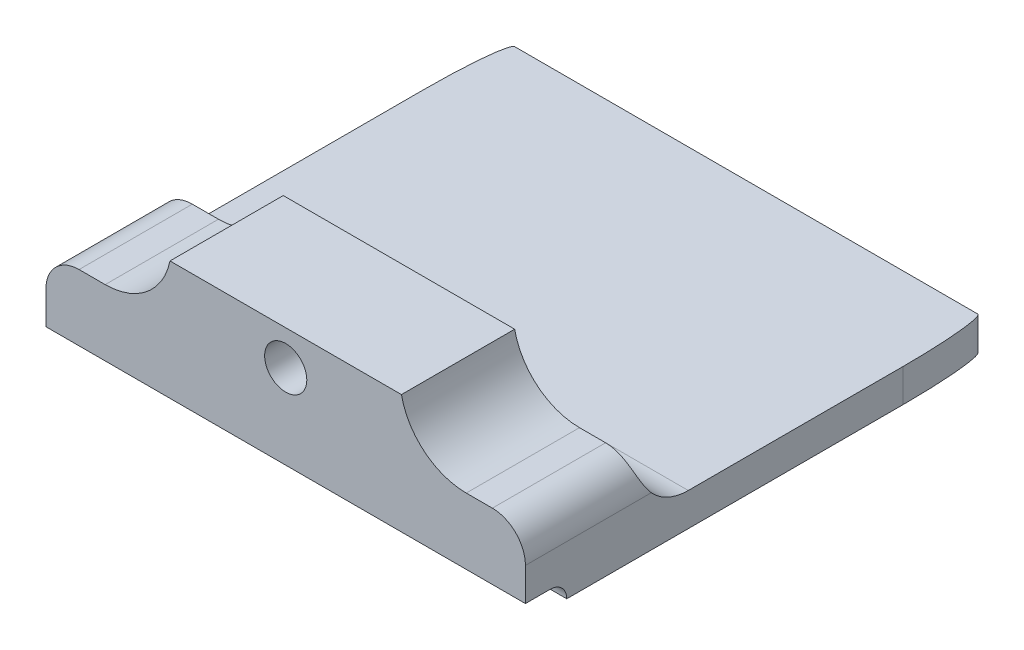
ISO-10303-21;
HEADER;
FILE_DESCRIPTION(('STEP AP214'),'2;1');
FILE_NAME('part.step','',(''),(''),'','','');
FILE_SCHEMA(('AUTOMOTIVE_DESIGN { 1 0 10303 214 1 1 1 1 }'));
ENDSEC;
DATA;
#1=APPLICATION_CONTEXT('core data for automotive mechanical design processes');
#2=APPLICATION_PROTOCOL_DEFINITION('international standard','automotive_design',2000,#1);
#3=PRODUCT_CONTEXT('',#1,'mechanical');
#4=PRODUCT('Part','Part','',(#3));
#5=PRODUCT_RELATED_PRODUCT_CATEGORY('part','',(#4));
#6=PRODUCT_DEFINITION_FORMATION('','',#4);
#7=PRODUCT_DEFINITION_CONTEXT('part definition',#1,'design');
#8=PRODUCT_DEFINITION('design','',#6,#7);
#9=PRODUCT_DEFINITION_SHAPE('','',#8);
#10=(LENGTH_UNIT() NAMED_UNIT(*) SI_UNIT(.MILLI.,.METRE.));
#11=(NAMED_UNIT(*) PLANE_ANGLE_UNIT() SI_UNIT($,.RADIAN.));
#12=(NAMED_UNIT(*) SI_UNIT($,.STERADIAN.) SOLID_ANGLE_UNIT());
#13=UNCERTAINTY_MEASURE_WITH_UNIT(LENGTH_MEASURE(1.E-05),#10,'distance_accuracy_value','');
#14=(GEOMETRIC_REPRESENTATION_CONTEXT(3) GLOBAL_UNCERTAINTY_ASSIGNED_CONTEXT((#13)) GLOBAL_UNIT_ASSIGNED_CONTEXT((#10,
#11,#12)) REPRESENTATION_CONTEXT('',''));
#15=CARTESIAN_POINT('',(0.,0.,0.));
#16=DIRECTION('',(0.,0.,1.));
#17=DIRECTION('',(1.,0.,0.));
#18=AXIS2_PLACEMENT_3D('',#15,#16,#17);
#19=CARTESIAN_POINT('',(0.,0.,-13.7));
#20=DIRECTION('',(0.,0.,1.));
#21=DIRECTION('',(1.,0.,0.));
#22=AXIS2_PLACEMENT_3D('',#19,#20,#21);
#23=PLANE('',#22);
#24=DIRECTION('',(1.,0.,0.));
#25=VECTOR('',#24,1.);
#26=CARTESIAN_POINT('',(-29.,-2.2,-13.7));
#27=LINE('',#26,#25);
#28=CARTESIAN_POINT('',(21.8383671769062,-2.2,-13.7));
#29=VERTEX_POINT('',#28);
#30=CARTESIAN_POINT('',(-21.8383671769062,-2.2,-13.7));
#31=VERTEX_POINT('',#30);
#32=EDGE_CURVE('E333',#29,#31,#27,.F.);
#33=ORIENTED_EDGE('',*,*,#32,.T.);
#34=CARTESIAN_POINT('',(-21.8383671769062,5.8,-13.7));
#35=DIRECTION('',(0.,0.,1.));
#36=DIRECTION('',(1.,0.,0.));
#37=AXIS2_PLACEMENT_3D('',#34,#35,#36);
#38=CIRCLE('',#37,8.);
#39=CARTESIAN_POINT('',(-14.,4.2,-13.7));
#40=VERTEX_POINT('',#39);
#41=EDGE_CURVE('E356',#31,#40,#38,.T.);
#42=ORIENTED_EDGE('',*,*,#41,.T.);
#43=DIRECTION('',(1.,0.,0.));
#44=VECTOR('',#43,1.);
#45=CARTESIAN_POINT('',(29.,4.2,-13.7));
#46=LINE('',#45,#44);
#47=CARTESIAN_POINT('',(14.,4.2,-13.7));
#48=VERTEX_POINT('',#47);
#49=EDGE_CURVE('E436',#40,#48,#46,.T.);
#50=ORIENTED_EDGE('',*,*,#49,.T.);
#51=CARTESIAN_POINT('',(21.8383671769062,5.8,-13.7));
#52=DIRECTION('',(0.,0.,1.));
#53=DIRECTION('',(1.,0.,0.));
#54=AXIS2_PLACEMENT_3D('',#51,#52,#53);
#55=CIRCLE('',#54,8.);
#56=EDGE_CURVE('E350',#48,#29,#55,.T.);
#57=ORIENTED_EDGE('',*,*,#56,.T.);
#58=EDGE_LOOP('',(#33,#42,#50,#57));
#59=FACE_BOUND('',#58,.T.);
#60=ADVANCED_FACE('F43',(#59),#23,.F.);
#61=CARTESIAN_POINT('',(-29.,-12.2,-12.2));
#62=DIRECTION('',(-1.,0.,0.));
#63=DIRECTION('',(0.,0.,1.));
#64=AXIS2_PLACEMENT_3D('',#61,#62,#63);
#65=PLANE('',#64);
#66=DIRECTION('',(0.,0.,1.));
#67=VECTOR('',#66,1.);
#68=CARTESIAN_POINT('',(-29.,-12.2,-12.2));
#69=LINE('',#68,#67);
#70=CARTESIAN_POINT('',(-29.,-12.2,-45.7));
#71=VERTEX_POINT('',#70);
#72=CARTESIAN_POINT('',(-29.,-12.2,-5.));
#73=VERTEX_POINT('',#72);
#74=EDGE_CURVE('E183',#71,#73,#69,.T.);
#75=ORIENTED_EDGE('',*,*,#74,.T.);
#76=CARTESIAN_POINT('',(-29.,-12.2,-3.));
#77=DIRECTION('',(-1.,0.,0.));
#78=DIRECTION('',(0.,0.,1.));
#79=AXIS2_PLACEMENT_3D('',#76,#77,#78);
#80=CIRCLE('',#79,2.);
#81=CARTESIAN_POINT('',(-29.,-10.2,-3.));
#82=VERTEX_POINT('',#81);
#83=EDGE_CURVE('E51',#73,#82,#80,.F.);
#84=ORIENTED_EDGE('',*,*,#83,.T.);
#85=DIRECTION('',(0.,0.,-1.));
#86=VECTOR('',#85,1.);
#87=CARTESIAN_POINT('',(-29.,-10.2,0.));
#88=LINE('',#87,#86);
#89=CARTESIAN_POINT('',(-29.,-10.2,0.));
#90=VERTEX_POINT('',#89);
#91=EDGE_CURVE('E155',#90,#82,#88,.T.);
#92=ORIENTED_EDGE('',*,*,#91,.F.);
#93=DIRECTION('',(0.,-1.,0.));
#94=VECTOR('',#93,1.);
#95=CARTESIAN_POINT('',(-29.,-12.2,0.));
#96=LINE('',#95,#94);
#97=CARTESIAN_POINT('',(-29.,-6.2,0.));
#98=VERTEX_POINT('',#97);
#99=EDGE_CURVE('E164',#98,#90,#96,.T.);
#100=ORIENTED_EDGE('',*,*,#99,.F.);
#101=DIRECTION('',(0.,0.,1.));
#102=VECTOR('',#101,1.);
#103=CARTESIAN_POINT('',(-29.,-6.2,-13.7));
#104=LINE('',#103,#102);
#105=CARTESIAN_POINT('',(-29.,-6.2,-15.2278640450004));
#106=VERTEX_POINT('',#105);
#107=EDGE_CURVE('E160',#98,#106,#104,.F.);
#108=ORIENTED_EDGE('',*,*,#107,.T.);
#109=CARTESIAN_POINT('',(-29.,-2.2,-19.7));
#110=DIRECTION('',(-1.,0.,0.));
#111=DIRECTION('',(0.,0.,1.));
#112=AXIS2_PLACEMENT_3D('',#109,#110,#111);
#113=CIRCLE('',#112,6.);
#114=CARTESIAN_POINT('',(-29.,-8.2,-19.7));
#115=VERTEX_POINT('',#114);
#116=EDGE_CURVE('E340',#106,#115,#113,.F.);
#117=ORIENTED_EDGE('',*,*,#116,.T.);
#118=DIRECTION('',(0.,0.,1.));
#119=VECTOR('',#118,1.);
#120=CARTESIAN_POINT('',(-29.,-8.2,-55.7));
#121=LINE('',#120,#119);
#122=CARTESIAN_POINT('',(-29.,-8.2,-45.7));
#123=VERTEX_POINT('',#122);
#124=EDGE_CURVE('E455',#123,#115,#121,.T.);
#125=ORIENTED_EDGE('',*,*,#124,.F.);
#126=CARTESIAN_POINT('',(-29.,-12.4,-45.7));
#127=CARTESIAN_POINT('',(-29.,-10.9333333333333,-45.7));
#128=CARTESIAN_POINT('',(-29.,-9.46666666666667,-45.7));
#129=CARTESIAN_POINT('',(-29.,-8.,-45.7));
#130=(BOUNDED_CURVE() B_SPLINE_CURVE(3,(#126,#127,#128,#129),.UNSPECIFIED.,.F.,
.F.) B_SPLINE_CURVE_WITH_KNOTS((4,4),(0.008,0.0124),
.UNSPECIFIED.) CURVE() GEOMETRIC_REPRESENTATION_ITEM() RATIONAL_B_SPLINE_CURVE((1.,1.,1.,1.)) REPRESENTATION_ITEM(''));
#131=EDGE_CURVE('E482',#123,#71,#130,.F.);
#132=ORIENTED_EDGE('',*,*,#131,.T.);
#133=EDGE_LOOP('',(#75,#84,#92,#100,#108,#117,#125,#132));
#134=FACE_BOUND('',#133,.T.);
#135=ADVANCED_FACE('F163',(#134),#65,.T.);
#136=CARTESIAN_POINT('',(-29.,4.2,-12.2));
#137=DIRECTION('',(0.,1.,0.));
#138=DIRECTION('',(0.,0.,1.));
#139=AXIS2_PLACEMENT_3D('',#136,#137,#138);
#140=PLANE('',#139);
#141=DIRECTION('',(0.,0.,1.));
#142=VECTOR('',#141,1.);
#143=CARTESIAN_POINT('',(-14.,4.2,-55.751));
#144=LINE('',#143,#142);
#145=CARTESIAN_POINT('',(-14.,4.2,0.));
#146=VERTEX_POINT('',#145);
#147=EDGE_CURVE('E433',#40,#146,#144,.T.);
#148=ORIENTED_EDGE('',*,*,#147,.T.);
#149=DIRECTION('',(-1.,0.,0.));
#150=VECTOR('',#149,1.);
#151=CARTESIAN_POINT('',(-29.,4.2,0.));
#152=LINE('',#151,#150);
#153=CARTESIAN_POINT('',(14.,4.2,0.));
#154=VERTEX_POINT('',#153);
#155=EDGE_CURVE('E174',#154,#146,#152,.T.);
#156=ORIENTED_EDGE('',*,*,#155,.F.);
#157=DIRECTION('',(0.,0.,1.));
#158=VECTOR('',#157,1.);
#159=CARTESIAN_POINT('',(14.,4.2,-55.751));
#160=LINE('',#159,#158);
#161=EDGE_CURVE('E446',#48,#154,#160,.T.);
#162=ORIENTED_EDGE('',*,*,#161,.F.);
#163=ORIENTED_EDGE('',*,*,#49,.F.);
#164=EDGE_LOOP('',(#148,#156,#162,#163));
#165=FACE_BOUND('',#164,.T.);
#166=ADVANCED_FACE('F407',(#165),#140,.T.);
#167=CARTESIAN_POINT('',(29.,-12.2,-12.2));
#168=DIRECTION('',(1.,0.,0.));
#169=DIRECTION('',(0.,0.,-1.));
#170=AXIS2_PLACEMENT_3D('',#167,#168,#169);
#171=PLANE('',#170);
#172=DIRECTION('',(0.,0.,1.));
#173=VECTOR('',#172,1.);
#174=CARTESIAN_POINT('',(29.,-10.2,-12.2));
#175=LINE('',#174,#173);
#176=CARTESIAN_POINT('',(29.,-10.2,-3.));
#177=VERTEX_POINT('',#176);
#178=CARTESIAN_POINT('',(29.,-10.2,0.));
#179=VERTEX_POINT('',#178);
#180=EDGE_CURVE('E156',#177,#179,#175,.T.);
#181=ORIENTED_EDGE('',*,*,#180,.F.);
#182=CARTESIAN_POINT('',(29.,-12.2,-3.));
#183=DIRECTION('',(1.,0.,0.));
#184=DIRECTION('',(0.,0.,-1.));
#185=AXIS2_PLACEMENT_3D('',#182,#183,#184);
#186=CIRCLE('',#185,2.);
#187=CARTESIAN_POINT('',(29.,-12.2,-5.));
#188=VERTEX_POINT('',#187);
#189=EDGE_CURVE('E12',#177,#188,#186,.F.);
#190=ORIENTED_EDGE('',*,*,#189,.T.);
#191=DIRECTION('',(0.,0.,1.));
#192=VECTOR('',#191,1.);
#193=CARTESIAN_POINT('',(29.,-12.2,-12.2));
#194=LINE('',#193,#192);
#195=CARTESIAN_POINT('',(29.,-12.2,-45.7));
#196=VERTEX_POINT('',#195);
#197=EDGE_CURVE('E189',#196,#188,#194,.T.);
#198=ORIENTED_EDGE('',*,*,#197,.F.);
#199=CARTESIAN_POINT('',(29.,-8.,-45.7));
#200=CARTESIAN_POINT('',(29.,-9.46666666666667,-45.7));
#201=CARTESIAN_POINT('',(29.,-10.9333333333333,-45.7));
#202=CARTESIAN_POINT('',(29.,-12.4,-45.7));
#203=(BOUNDED_CURVE() B_SPLINE_CURVE(3,(#199,#200,#201,#202),.UNSPECIFIED.,.F.,
.F.) B_SPLINE_CURVE_WITH_KNOTS((4,4),(-0.0124,-0.008),
.UNSPECIFIED.) CURVE() GEOMETRIC_REPRESENTATION_ITEM() RATIONAL_B_SPLINE_CURVE((1.,1.,1.,1.)) REPRESENTATION_ITEM(''));
#204=CARTESIAN_POINT('',(29.,-8.2,-45.7));
#205=VERTEX_POINT('',#204);
#206=EDGE_CURVE('E499',#196,#205,#203,.F.);
#207=ORIENTED_EDGE('',*,*,#206,.T.);
#208=DIRECTION('',(0.,0.,1.));
#209=VECTOR('',#208,1.);
#210=CARTESIAN_POINT('',(29.,-8.2,-55.7));
#211=LINE('',#210,#209);
#212=CARTESIAN_POINT('',(29.,-8.2,-19.7));
#213=VERTEX_POINT('',#212);
#214=EDGE_CURVE('E207',#205,#213,#211,.T.);
#215=ORIENTED_EDGE('',*,*,#214,.T.);
#216=CARTESIAN_POINT('',(29.,-2.2,-19.7));
#217=DIRECTION('',(1.,0.,0.));
#218=DIRECTION('',(0.,0.,-1.));
#219=AXIS2_PLACEMENT_3D('',#216,#217,#218);
#220=CIRCLE('',#219,6.);
#221=CARTESIAN_POINT('',(29.,-6.2,-15.2278640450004));
#222=VERTEX_POINT('',#221);
#223=EDGE_CURVE('E337',#213,#222,#220,.F.);
#224=ORIENTED_EDGE('',*,*,#223,.T.);
#225=DIRECTION('',(0.,0.,1.));
#226=VECTOR('',#225,1.);
#227=CARTESIAN_POINT('',(29.,-6.2,0.));
#228=LINE('',#227,#226);
#229=CARTESIAN_POINT('',(29.,-6.2,0.));
#230=VERTEX_POINT('',#229);
#231=EDGE_CURVE('E358',#222,#230,#228,.T.);
#232=ORIENTED_EDGE('',*,*,#231,.T.);
#233=DIRECTION('',(0.,1.,0.));
#234=VECTOR('',#233,1.);
#235=CARTESIAN_POINT('',(29.,-12.2,0.));
#236=LINE('',#235,#234);
#237=EDGE_CURVE('E171',#179,#230,#236,.T.);
#238=ORIENTED_EDGE('',*,*,#237,.F.);
#239=EDGE_LOOP('',(#181,#190,#198,#207,#215,#224,#232,#238));
#240=FACE_BOUND('',#239,.T.);
#241=ADVANCED_FACE('F220',(#240),#171,.T.);
#242=CARTESIAN_POINT('',(-29.,-12.2,-12.2));
#243=DIRECTION('',(0.,-1.,0.));
#244=DIRECTION('',(0.,0.,-1.));
#245=AXIS2_PLACEMENT_3D('',#242,#243,#244);
#246=PLANE('',#245);
#247=DIRECTION('',(-1.,0.,0.));
#248=VECTOR('',#247,1.);
#249=CARTESIAN_POINT('',(29.05,-12.2,-5.));
#250=LINE('',#249,#248);
#251=EDGE_CURVE('E166',#188,#73,#250,.T.);
#252=ORIENTED_EDGE('',*,*,#251,.T.);
#253=ORIENTED_EDGE('',*,*,#74,.F.);
#254=CARTESIAN_POINT('',(-28.,-12.2,-55.7));
#255=CARTESIAN_POINT('',(-29.,-12.2,-55.7));
#256=CARTESIAN_POINT('',(-29.,-12.2,-45.7));
#257=(BOUNDED_CURVE() B_SPLINE_CURVE(2,(#254,#255,#256),.UNSPECIFIED.,.F.,
.F.) B_SPLINE_CURVE_WITH_KNOTS((3,3),(0.,1.),
.UNSPECIFIED.) CURVE() GEOMETRIC_REPRESENTATION_ITEM() RATIONAL_B_SPLINE_CURVE((1.,
0.707106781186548,1.)) REPRESENTATION_ITEM(''));
#258=CARTESIAN_POINT('',(-28.,-12.2,-55.7));
#259=VERTEX_POINT('',#258);
#260=EDGE_CURVE('E334',#71,#259,#257,.F.);
#261=ORIENTED_EDGE('',*,*,#260,.T.);
#262=DIRECTION('',(-1.,0.,0.));
#263=VECTOR('',#262,1.);
#264=CARTESIAN_POINT('',(29.,-12.2,-55.7));
#265=LINE('',#264,#263);
#266=CARTESIAN_POINT('',(28.,-12.2,-55.7));
#267=VERTEX_POINT('',#266);
#268=EDGE_CURVE('E508',#267,#259,#265,.T.);
#269=ORIENTED_EDGE('',*,*,#268,.F.);
#270=CARTESIAN_POINT('',(29.,-12.2,-45.7));
#271=CARTESIAN_POINT('',(29.,-12.2,-55.7));
#272=CARTESIAN_POINT('',(28.,-12.2,-55.7));
#273=(BOUNDED_CURVE() B_SPLINE_CURVE(2,(#270,#271,#272),.UNSPECIFIED.,.F.,
.F.) B_SPLINE_CURVE_WITH_KNOTS((3,3),(0.,1.),
.UNSPECIFIED.) CURVE() GEOMETRIC_REPRESENTATION_ITEM() RATIONAL_B_SPLINE_CURVE((1.,
0.707106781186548,1.)) REPRESENTATION_ITEM(''));
#274=EDGE_CURVE('E201',#267,#196,#273,.F.);
#275=ORIENTED_EDGE('',*,*,#274,.T.);
#276=ORIENTED_EDGE('',*,*,#197,.T.);
#277=EDGE_LOOP('',(#252,#253,#261,#269,#275,#276));
#278=FACE_BOUND('',#277,.T.);
#279=ADVANCED_FACE('F210',(#278),#246,.T.);
#280=CARTESIAN_POINT('',(0.,0.,0.));
#281=DIRECTION('',(0.,0.,-1.));
#282=DIRECTION('',(-1.,0.,0.));
#283=AXIS2_PLACEMENT_3D('',#280,#281,#282);
#284=PLANE('',#283);
#285=CARTESIAN_POINT('',(0.,0.,0.));
#286=DIRECTION('',(0.,0.,1.));
#287=DIRECTION('',(1.,0.,0.));
#288=AXIS2_PLACEMENT_3D('',#285,#286,#287);
#289=CIRCLE('',#288,2.55);
#290=CARTESIAN_POINT('',(2.55,0.,0.));
#291=VERTEX_POINT('',#290);
#292=EDGE_CURVE('E177',#291,#291,#289,.T.);
#293=ORIENTED_EDGE('',*,*,#292,.F.);
#294=EDGE_LOOP('',(#293));
#295=FACE_BOUND('',#294,.T.);
#296=ORIENTED_EDGE('',*,*,#99,.T.);
#297=DIRECTION('',(1.,0.,0.));
#298=VECTOR('',#297,1.);
#299=CARTESIAN_POINT('',(0.,-10.2,0.));
#300=LINE('',#299,#298);
#301=EDGE_CURVE('E153',#90,#179,#300,.T.);
#302=ORIENTED_EDGE('',*,*,#301,.T.);
#303=ORIENTED_EDGE('',*,*,#237,.T.);
#304=CARTESIAN_POINT('',(25.,-6.2,0.));
#305=DIRECTION('',(0.,0.,-1.));
#306=DIRECTION('',(-1.,0.,0.));
#307=AXIS2_PLACEMENT_3D('',#304,#305,#306);
#308=CIRCLE('',#307,4.);
#309=CARTESIAN_POINT('',(25.,-2.2,0.));
#310=VERTEX_POINT('',#309);
#311=EDGE_CURVE('E362',#230,#310,#308,.F.);
#312=ORIENTED_EDGE('',*,*,#311,.T.);
#313=DIRECTION('',(1.,0.,0.));
#314=VECTOR('',#313,1.);
#315=CARTESIAN_POINT('',(29.,-2.2,0.));
#316=LINE('',#315,#314);
#317=CARTESIAN_POINT('',(21.8383671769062,-2.2,0.));
#318=VERTEX_POINT('',#317);
#319=EDGE_CURVE('E444',#318,#310,#316,.T.);
#320=ORIENTED_EDGE('',*,*,#319,.F.);
#321=CARTESIAN_POINT('',(21.8383671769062,5.8,0.));
#322=DIRECTION('',(0.,0.,-1.));
#323=DIRECTION('',(-1.,0.,0.));
#324=AXIS2_PLACEMENT_3D('',#321,#322,#323);
#325=CIRCLE('',#324,8.);
#326=EDGE_CURVE('E348',#318,#154,#325,.T.);
#327=ORIENTED_EDGE('',*,*,#326,.T.);
#328=ORIENTED_EDGE('',*,*,#155,.T.);
#329=CARTESIAN_POINT('',(-21.8383671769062,5.8,0.));
#330=DIRECTION('',(0.,0.,-1.));
#331=DIRECTION('',(-1.,0.,0.));
#332=AXIS2_PLACEMENT_3D('',#329,#330,#331);
#333=CIRCLE('',#332,8.);
#334=CARTESIAN_POINT('',(-21.8383671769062,-2.2,0.));
#335=VERTEX_POINT('',#334);
#336=EDGE_CURVE('E353',#146,#335,#333,.T.);
#337=ORIENTED_EDGE('',*,*,#336,.T.);
#338=DIRECTION('',(1.,0.,0.));
#339=VECTOR('',#338,1.);
#340=CARTESIAN_POINT('',(-29.,-2.2,0.));
#341=LINE('',#340,#339);
#342=CARTESIAN_POINT('',(-25.,-2.2,0.));
#343=VERTEX_POINT('',#342);
#344=EDGE_CURVE('E439',#343,#335,#341,.T.);
#345=ORIENTED_EDGE('',*,*,#344,.F.);
#346=CARTESIAN_POINT('',(-25.,-6.2,0.));
#347=DIRECTION('',(0.,0.,-1.));
#348=DIRECTION('',(-1.,0.,0.));
#349=AXIS2_PLACEMENT_3D('',#346,#347,#348);
#350=CIRCLE('',#349,4.);
#351=EDGE_CURVE('E170',#343,#98,#350,.F.);
#352=ORIENTED_EDGE('',*,*,#351,.T.);
#353=EDGE_LOOP('',(#296,#302,#303,#312,#320,#327,#328,#337,#345,#352));
#354=FACE_BOUND('',#353,.T.);
#355=ADVANCED_FACE('F168',(#295,#354),#284,.F.);
#356=CARTESIAN_POINT('',(0.,0.,-12.2));
#357=DIRECTION('',(0.,0.,1.));
#358=DIRECTION('',(1.,0.,0.));
#359=AXIS2_PLACEMENT_3D('',#356,#357,#358);
#360=CYLINDRICAL_SURFACE('',#359,2.55);
#361=CARTESIAN_POINT('',(0.,0.,-12.2));
#362=DIRECTION('',(0.,0.,1.));
#363=DIRECTION('',(1.,0.,0.));
#364=AXIS2_PLACEMENT_3D('',#361,#362,#363);
#365=CIRCLE('',#364,2.55);
#366=CARTESIAN_POINT('',(2.55,0.,-12.2));
#367=VERTEX_POINT('',#366);
#368=EDGE_CURVE('E172',#367,#367,#365,.T.);
#369=ORIENTED_EDGE('',*,*,#368,.F.);
#370=EDGE_LOOP('',(#369));
#371=FACE_BOUND('',#370,.T.);
#372=ORIENTED_EDGE('',*,*,#292,.T.);
#373=EDGE_LOOP('',(#372));
#374=FACE_BOUND('',#373,.T.);
#375=ADVANCED_FACE('F415',(#371,#374),#360,.F.);
#376=CARTESIAN_POINT('',(0.,0.,-12.2));
#377=DIRECTION('',(0.,0.,1.));
#378=DIRECTION('',(1.,0.,0.));
#379=AXIS2_PLACEMENT_3D('',#376,#377,#378);
#380=PLANE('',#379);
#381=ORIENTED_EDGE('',*,*,#368,.T.);
#382=EDGE_LOOP('',(#381));
#383=FACE_BOUND('',#382,.T.);
#384=ADVANCED_FACE('F412',(#383),#380,.T.);
#385=CARTESIAN_POINT('',(29.,-8.2,-55.7));
#386=DIRECTION('',(0.,-1.,0.));
#387=DIRECTION('',(0.,0.,-1.));
#388=AXIS2_PLACEMENT_3D('',#385,#386,#387);
#389=PLANE('',#388);
#390=ORIENTED_EDGE('',*,*,#124,.T.);
#391=DIRECTION('',(1.,0.,0.));
#392=VECTOR('',#391,1.);
#393=CARTESIAN_POINT('',(29.,-8.2,-19.7));
#394=LINE('',#393,#392);
#395=EDGE_CURVE('E325',#115,#213,#394,.T.);
#396=ORIENTED_EDGE('',*,*,#395,.T.);
#397=ORIENTED_EDGE('',*,*,#214,.F.);
#398=CARTESIAN_POINT('',(28.,-8.2,-55.7));
#399=CARTESIAN_POINT('',(29.,-8.2,-55.7));
#400=CARTESIAN_POINT('',(29.,-8.2,-45.7));
#401=(BOUNDED_CURVE() B_SPLINE_CURVE(2,(#398,#399,#400),.UNSPECIFIED.,.F.,
.F.) B_SPLINE_CURVE_WITH_KNOTS((3,3),(0.,1.),
.UNSPECIFIED.) CURVE() GEOMETRIC_REPRESENTATION_ITEM() RATIONAL_B_SPLINE_CURVE((1.,
0.707106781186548,1.)) REPRESENTATION_ITEM(''));
#402=CARTESIAN_POINT('',(28.,-8.2,-55.7));
#403=VERTEX_POINT('',#402);
#404=EDGE_CURVE('E497',#205,#403,#401,.F.);
#405=ORIENTED_EDGE('',*,*,#404,.T.);
#406=DIRECTION('',(1.,0.,0.));
#407=VECTOR('',#406,1.);
#408=CARTESIAN_POINT('',(29.,-8.2,-55.7));
#409=LINE('',#408,#407);
#410=CARTESIAN_POINT('',(-28.,-8.2,-55.7));
#411=VERTEX_POINT('',#410);
#412=EDGE_CURVE('E509',#411,#403,#409,.T.);
#413=ORIENTED_EDGE('',*,*,#412,.F.);
#414=CARTESIAN_POINT('',(-29.,-8.2,-45.7));
#415=CARTESIAN_POINT('',(-29.,-8.2,-55.7));
#416=CARTESIAN_POINT('',(-28.,-8.2,-55.7));
#417=(BOUNDED_CURVE() B_SPLINE_CURVE(2,(#414,#415,#416),.UNSPECIFIED.,.F.,
.F.) B_SPLINE_CURVE_WITH_KNOTS((3,3),(0.,1.),
.UNSPECIFIED.) CURVE() GEOMETRIC_REPRESENTATION_ITEM() RATIONAL_B_SPLINE_CURVE((1.,
0.707106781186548,1.)) REPRESENTATION_ITEM(''));
#418=EDGE_CURVE('E241',#411,#123,#417,.F.);
#419=ORIENTED_EDGE('',*,*,#418,.T.);
#420=EDGE_LOOP('',(#390,#396,#397,#405,#413,#419));
#421=FACE_BOUND('',#420,.T.);
#422=ADVANCED_FACE('F410',(#421),#389,.F.);
#423=CARTESIAN_POINT('',(0.,0.,-55.7));
#424=DIRECTION('',(0.,0.,1.));
#425=DIRECTION('',(1.,0.,0.));
#426=AXIS2_PLACEMENT_3D('',#423,#424,#425);
#427=PLANE('',#426);
#428=ORIENTED_EDGE('',*,*,#268,.T.);
#429=CARTESIAN_POINT('',(-28.,-8.,-55.7));
#430=CARTESIAN_POINT('',(-28.,-9.46666666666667,-55.7));
#431=CARTESIAN_POINT('',(-28.,-10.9333333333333,-55.7));
#432=CARTESIAN_POINT('',(-28.,-12.4,-55.7));
#433=(BOUNDED_CURVE() B_SPLINE_CURVE(3,(#429,#430,#431,#432),.UNSPECIFIED.,.F.,
.F.) B_SPLINE_CURVE_WITH_KNOTS((4,4),(0.008,0.0124),
.UNSPECIFIED.) CURVE() GEOMETRIC_REPRESENTATION_ITEM() RATIONAL_B_SPLINE_CURVE((1.,1.,1.,1.)) REPRESENTATION_ITEM(''));
#434=EDGE_CURVE('E495',#259,#411,#433,.F.);
#435=ORIENTED_EDGE('',*,*,#434,.T.);
#436=ORIENTED_EDGE('',*,*,#412,.T.);
#437=CARTESIAN_POINT('',(28.,-12.4,-55.7));
#438=CARTESIAN_POINT('',(28.,-10.9333333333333,-55.7));
#439=CARTESIAN_POINT('',(28.,-9.46666666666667,-55.7));
#440=CARTESIAN_POINT('',(28.,-8.,-55.7));
#441=(BOUNDED_CURVE() B_SPLINE_CURVE(3,(#437,#438,#439,#440),.UNSPECIFIED.,.F.,
.F.) B_SPLINE_CURVE_WITH_KNOTS((4,4),(-0.0124,-0.008),
.UNSPECIFIED.) CURVE() GEOMETRIC_REPRESENTATION_ITEM() RATIONAL_B_SPLINE_CURVE((1.,1.,1.,1.)) REPRESENTATION_ITEM(''));
#442=EDGE_CURVE('E193',#403,#267,#441,.F.);
#443=ORIENTED_EDGE('',*,*,#442,.T.);
#444=EDGE_LOOP('',(#428,#435,#436,#443));
#445=FACE_BOUND('',#444,.T.);
#446=ADVANCED_FACE('F507',(#445),#427,.F.);
#447=CARTESIAN_POINT('',(29.,-12.4,-45.7));
#448=CARTESIAN_POINT('',(29.,-10.9333333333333,-45.7));
#449=CARTESIAN_POINT('',(29.,-9.46666666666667,-45.7));
#450=CARTESIAN_POINT('',(29.,-8.,-45.7));
#451=CARTESIAN_POINT('',(29.,-12.4,-55.7));
#452=CARTESIAN_POINT('',(29.,-10.9333333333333,-55.7));
#453=CARTESIAN_POINT('',(29.,-9.46666666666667,-55.7));
#454=CARTESIAN_POINT('',(29.,-8.,-55.7));
#455=CARTESIAN_POINT('',(28.,-12.4,-55.7));
#456=CARTESIAN_POINT('',(28.,-10.9333333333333,-55.7));
#457=CARTESIAN_POINT('',(28.,-9.46666666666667,-55.7));
#458=CARTESIAN_POINT('',(28.,-8.,-55.7));
#459=(BOUNDED_SURFACE() B_SPLINE_SURFACE(2,3,((#447,#448,#449,#450),(#451,#452,#453,#454),(#455,
#456,#457,#458)),.UNSPECIFIED.,.F.,.F.,.F.) B_SPLINE_SURFACE_WITH_KNOTS((3,3),(4,4),(0.,1.),
(-0.0124,-0.008),.UNSPECIFIED.) GEOMETRIC_REPRESENTATION_ITEM() RATIONAL_B_SPLINE_SURFACE(((1.,
1.,1.,1.),(0.707106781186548,0.707106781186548,0.707106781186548,0.707106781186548),(1.,1.,1.,1.))) REPRESENTATION_ITEM('') SURFACE());
#460=ORIENTED_EDGE('',*,*,#404,.F.);
#461=ORIENTED_EDGE('',*,*,#206,.F.);
#462=ORIENTED_EDGE('',*,*,#274,.F.);
#463=ORIENTED_EDGE('',*,*,#442,.F.);
#464=EDGE_LOOP('',(#460,#461,#462,#463));
#465=FACE_BOUND('',#464,.T.);
#466=ADVANCED_FACE('F263',(#465),#459,.T.);
#467=CARTESIAN_POINT('',(-29.,-8.,-45.7));
#468=CARTESIAN_POINT('',(-29.,-9.46666666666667,-45.7));
#469=CARTESIAN_POINT('',(-29.,-10.9333333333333,-45.7));
#470=CARTESIAN_POINT('',(-29.,-12.4,-45.7));
#471=CARTESIAN_POINT('',(-29.,-8.,-55.7));
#472=CARTESIAN_POINT('',(-29.,-9.46666666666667,-55.7));
#473=CARTESIAN_POINT('',(-29.,-10.9333333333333,-55.7));
#474=CARTESIAN_POINT('',(-29.,-12.4,-55.7));
#475=CARTESIAN_POINT('',(-28.,-8.,-55.7));
#476=CARTESIAN_POINT('',(-28.,-9.46666666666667,-55.7));
#477=CARTESIAN_POINT('',(-28.,-10.9333333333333,-55.7));
#478=CARTESIAN_POINT('',(-28.,-12.4,-55.7));
#479=(BOUNDED_SURFACE() B_SPLINE_SURFACE(2,3,((#467,#468,#469,#470),(#471,#472,#473,#474),(#475,
#476,#477,#478)),.UNSPECIFIED.,.F.,.F.,.F.) B_SPLINE_SURFACE_WITH_KNOTS((3,3),(4,4),(0.,1.),
(0.008,0.0124),.UNSPECIFIED.) GEOMETRIC_REPRESENTATION_ITEM() RATIONAL_B_SPLINE_SURFACE(((1.,1.,
1.,1.),(0.707106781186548,0.707106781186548,0.707106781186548,0.707106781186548),(1.,1.,1.,1.))) REPRESENTATION_ITEM('') SURFACE());
#480=ORIENTED_EDGE('',*,*,#260,.F.);
#481=ORIENTED_EDGE('',*,*,#131,.F.);
#482=ORIENTED_EDGE('',*,*,#418,.F.);
#483=ORIENTED_EDGE('',*,*,#434,.F.);
#484=EDGE_LOOP('',(#480,#481,#482,#483));
#485=FACE_BOUND('',#484,.T.);
#486=ADVANCED_FACE('F248',(#485),#479,.T.);
#487=CARTESIAN_POINT('',(29.,-2.2,-19.7));
#488=DIRECTION('',(-1.,0.,0.));
#489=DIRECTION('',(0.,0.,1.));
#490=AXIS2_PLACEMENT_3D('',#487,#488,#489);
#491=CYLINDRICAL_SURFACE('',#490,6.);
#492=CARTESIAN_POINT('',(25.,-2.2,-13.7));
#493=VERTEX_POINT('',#492);
#494=EDGE_CURVE('E335',#493,#29,#27,.F.);
#495=ORIENTED_EDGE('',*,*,#494,.F.);
#496=CARTESIAN_POINT('',(25.,-2.2,-13.7));
#497=CARTESIAN_POINT('',(25.1119914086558,-2.1999881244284,-13.7000234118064));
#498=CARTESIAN_POINT('',(25.2239811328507,-2.20470278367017,-13.700000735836));
#499=CARTESIAN_POINT('',(25.4471686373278,-2.22349955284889,-13.7000324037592));
#500=CARTESIAN_POINT('',(25.558366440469,-2.23758139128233,-13.7000867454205));
#501=CARTESIAN_POINT('',(25.7792264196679,-2.27503340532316,-13.7004416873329));
#502=CARTESIAN_POINT('',(25.8888880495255,-2.29840680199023,-13.7007423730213));
#503=CARTESIAN_POINT('',(26.1058594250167,-2.35427220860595,-13.7019182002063));
#504=CARTESIAN_POINT('',(26.2131691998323,-2.38676410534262,-13.702793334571));
#505=CARTESIAN_POINT('',(26.4247350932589,-2.46065614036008,-13.7055506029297));
#506=CARTESIAN_POINT('',(26.5289893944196,-2.50206146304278,-13.7074333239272));
#507=CARTESIAN_POINT('',(26.7336592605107,-2.5934793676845,-13.7127410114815));
#508=CARTESIAN_POINT('',(26.834073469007,-2.6434949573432,-13.7161665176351));
#509=CARTESIAN_POINT('',(27.0302227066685,-2.75170561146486,-13.7251723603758));
#510=CARTESIAN_POINT('',(27.1259603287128,-2.80989607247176,-13.7307514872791));
#511=CARTESIAN_POINT('',(27.3120771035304,-2.93399216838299,-13.744737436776));
#512=CARTESIAN_POINT('',(27.402456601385,-2.99989730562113,-13.7531440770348));
#513=CARTESIAN_POINT('',(27.5755838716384,-3.13758586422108,-13.7733074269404));
#514=CARTESIAN_POINT('',(27.6584392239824,-3.20924307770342,-13.7850015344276));
#515=CARTESIAN_POINT('',(27.8176178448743,-3.35870762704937,-13.8124568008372));
#516=CARTESIAN_POINT('',(27.8939439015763,-3.43651231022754,-13.8282162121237));
#517=CARTESIAN_POINT('',(28.0394858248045,-3.59744522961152,-13.8644242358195));
#518=CARTESIAN_POINT('',(28.1087044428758,-3.68057138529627,-13.8848710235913));
#519=CARTESIAN_POINT('',(28.2395637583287,-3.85121633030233,-13.9310059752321));
#520=CARTESIAN_POINT('',(28.301205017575,-3.93873479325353,-13.9566937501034));
#521=CARTESIAN_POINT('',(28.4125572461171,-4.11092617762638,-14.0117701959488));
#522=CARTESIAN_POINT('',(28.4627982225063,-4.19537797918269,-14.0407805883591));
#523=CARTESIAN_POINT('',(28.5562465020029,-4.36626154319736,-14.1039647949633));
#524=CARTESIAN_POINT('',(28.5994514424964,-4.45269395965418,-14.1381403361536));
#525=CARTESIAN_POINT('',(28.6787695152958,-4.62653810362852,-14.2117561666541));
#526=CARTESIAN_POINT('',(28.7148839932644,-4.71394964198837,-14.2511954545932));
#527=CARTESIAN_POINT('',(28.7801633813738,-4.88886161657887,-14.3353520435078));
#528=CARTESIAN_POINT('',(28.8093258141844,-4.97636207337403,-14.3800712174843));
#529=CARTESIAN_POINT('',(28.8603790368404,-5.14863648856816,-14.4736310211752));
#530=CARTESIAN_POINT('',(28.8824152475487,-5.2334281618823,-14.5223597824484));
#531=CARTESIAN_POINT('',(28.9204393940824,-5.40150542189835,-14.6245624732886));
#532=CARTESIAN_POINT('',(28.9364246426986,-5.48479032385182,-14.6780384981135));
#533=CARTESIAN_POINT('',(28.9759070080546,-5.73121565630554,-14.8451339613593));
#534=CARTESIAN_POINT('',(28.9910191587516,-5.89123982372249,-14.9655896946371));
#535=CARTESIAN_POINT('',(28.9980072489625,-6.07102255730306,-15.1156384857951));
#536=CARTESIAN_POINT('',(28.998760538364,-6.09710129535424,-15.1377877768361));
#537=CARTESIAN_POINT('',(28.999756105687,-6.14884836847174,-15.1825055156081));
#538=CARTESIAN_POINT('',(28.9999990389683,-6.17451718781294,-15.2050733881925));
#539=CARTESIAN_POINT('',(29.,-6.2,-15.2278640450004));
#540=B_SPLINE_CURVE_WITH_KNOTS('',3,(#496,#497,#498,#499,#500,#501,#502,#503,#504,#505,#506,
#507,#508,#509,#510,#511,#512,#513,#514,#515,#516,#517,#518,#519,#520,#521,#522,#523,#524,#525,
#526,#527,#528,#529,#530,#531,#532,#533,#534,#535,#536,#537,#538,#539),.UNSPECIFIED.,.F.,.F.,(4,
2,2,2,2,2,2,2,2,2,2,2,2,2,2,2,2,2,2,2,2,4),(0.,0.33587264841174,0.671735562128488,
1.00771500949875,1.34369028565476,1.67986150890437,2.01615040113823,2.35225067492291,
2.68832927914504,3.01839738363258,3.34832383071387,3.67812206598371,4.00789583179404,
4.31488712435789,4.62198128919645,4.92901711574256,5.23616219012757,5.53657266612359,
5.83711639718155,6.43711485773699,6.53978732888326,6.64232787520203),.UNSPECIFIED.);
#541=EDGE_CURVE('E371',#493,#222,#540,.T.);
#542=ORIENTED_EDGE('',*,*,#541,.T.);
#543=ORIENTED_EDGE('',*,*,#223,.F.);
#544=ORIENTED_EDGE('',*,*,#395,.F.);
#545=ORIENTED_EDGE('',*,*,#116,.F.);
#546=CARTESIAN_POINT('',(-29.,-6.2,-15.2278640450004));
#547=CARTESIAN_POINT('',(-29.0000065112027,-6.11770110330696,-15.1542297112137));
#548=CARTESIAN_POINT('',(-28.9974596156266,-6.03331736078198,-15.0828682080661));
#549=CARTESIAN_POINT('',(-28.9865363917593,-5.86090824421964,-14.9450145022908));
#550=CARTESIAN_POINT('',(-28.9781549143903,-5.7728797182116,-14.8785266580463));
#551=CARTESIAN_POINT('',(-28.9547979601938,-5.59355423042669,-14.7506597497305));
#552=CARTESIAN_POINT('',(-28.9398002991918,-5.5022472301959,-14.6892987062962));
#553=CARTESIAN_POINT('',(-28.9025694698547,-5.31748810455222,-14.5723090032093));
#554=CARTESIAN_POINT('',(-28.8803384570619,-5.22403662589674,-14.5166786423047));
#555=CARTESIAN_POINT('',(-28.8279528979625,-5.03534553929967,-14.4110894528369));
#556=CARTESIAN_POINT('',(-28.7977507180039,-4.940098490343,-14.3611673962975));
#557=CARTESIAN_POINT('',(-28.7291165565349,-4.74950134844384,-14.2675683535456));
#558=CARTESIAN_POINT('',(-28.6906852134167,-4.65415126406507,-14.2238908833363));
#559=CARTESIAN_POINT('',(-28.6055230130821,-4.46479012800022,-14.1429050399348));
#560=CARTESIAN_POINT('',(-28.5588135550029,-4.37077628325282,-14.105580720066));
#561=CARTESIAN_POINT('',(-28.4570616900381,-4.18507302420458,-14.0370254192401));
#562=CARTESIAN_POINT('',(-28.4020201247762,-4.09338337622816,-14.0057938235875));
#563=CARTESIAN_POINT('',(-28.2894463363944,-3.92205507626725,-13.9517989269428));
#564=CARTESIAN_POINT('',(-28.2326459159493,-3.84209843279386,-13.9285133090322));
#565=CARTESIAN_POINT('',(-28.1126762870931,-3.68585003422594,-13.8863264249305));
#566=CARTESIAN_POINT('',(-28.0495050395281,-3.60955946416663,-13.8674265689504));
#567=CARTESIAN_POINT('',(-27.9171546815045,-3.46137196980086,-13.8335937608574));
#568=CARTESIAN_POINT('',(-27.8479724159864,-3.38947738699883,-13.8186629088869));
#569=CARTESIAN_POINT('',(-27.7040485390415,-3.25074281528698,-13.7922992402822));
#570=CARTESIAN_POINT('',(-27.6293047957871,-3.18390478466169,-13.7808677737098));
#571=CARTESIAN_POINT('',(-27.4740704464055,-3.05528667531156,-13.7609124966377));
#572=CARTESIAN_POINT('',(-27.3935343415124,-2.99355729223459,-13.7524156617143));
#573=CARTESIAN_POINT('',(-27.2278445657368,-2.87629286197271,-13.7379436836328));
#574=CARTESIAN_POINT('',(-27.1426892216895,-2.8207600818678,-13.7319694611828));
#575=CARTESIAN_POINT('',(-26.8810940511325,-2.66408247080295,-13.7170510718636));
#576=CARTESIAN_POINT('',(-26.6984406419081,-2.57278841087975,-13.711101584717));
#577=CARTESIAN_POINT('',(-26.3080767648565,-2.41363810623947,-13.7032344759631));
#578=CARTESIAN_POINT('',(-26.099507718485,-2.34789354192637,-13.7016314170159));
#579=CARTESIAN_POINT('',(-25.6746339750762,-2.25131023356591,-13.70002212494));
#580=CARTESIAN_POINT('',(-25.458343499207,-2.22041042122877,-13.7000130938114));
#581=CARTESIAN_POINT('',(-25.2011119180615,-2.20485449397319,-13.7000028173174));
#582=CARTESIAN_POINT('',(-25.1608855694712,-2.20303323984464,-13.70000122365));
#583=CARTESIAN_POINT('',(-25.0804432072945,-2.20060756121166,-13.6999993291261));
#584=CARTESIAN_POINT('',(-25.0402272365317,-2.20000171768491,-13.6999990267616));
#585=CARTESIAN_POINT('',(-25.,-2.2,-13.7));
#586=B_SPLINE_CURVE_WITH_KNOTS('',3,(#546,#547,#548,#549,#550,#551,#552,#553,#554,#555,#556,
#557,#558,#559,#560,#561,#562,#563,#564,#565,#566,#567,#568,#569,#570,#571,#572,#573,#574,#575,
#576,#577,#578,#579,#580,#581,#582,#583,#584,#585),.UNSPECIFIED.,.F.,.F.,(4,2,2,2,2,2,2,2,2,2,2,
2,2,2,2,2,2,2,2,4),(0.,0.331280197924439,0.662853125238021,0.995546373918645,1.32814057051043,
1.66276912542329,1.99737173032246,2.33112167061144,2.66483792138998,2.96689135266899,
3.26904177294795,3.5713517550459,3.87377822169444,4.17891493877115,4.48416292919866,
5.0943323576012,5.74761212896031,6.39974518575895,6.52054090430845,6.64119550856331),.UNSPECIFIED.);
#587=CARTESIAN_POINT('',(-25.,-2.2,-13.7));
#588=VERTEX_POINT('',#587);
#589=EDGE_CURVE('E366',#106,#588,#586,.T.);
#590=ORIENTED_EDGE('',*,*,#589,.T.);
#591=DIRECTION('',(-1.,0.,0.));
#592=VECTOR('',#591,1.);
#593=CARTESIAN_POINT('',(29.,-2.2,-13.7));
#594=LINE('',#593,#592);
#595=EDGE_CURVE('E438',#31,#588,#594,.T.);
#596=ORIENTED_EDGE('',*,*,#595,.F.);
#597=ORIENTED_EDGE('',*,*,#32,.F.);
#598=EDGE_LOOP('',(#495,#542,#543,#544,#545,#590,#596,#597));
#599=FACE_BOUND('',#598,.T.);
#600=ADVANCED_FACE('F262',(#599),#491,.F.);
#601=CARTESIAN_POINT('',(29.,-2.2,-55.751));
#602=DIRECTION('',(0.,-1.,0.));
#603=DIRECTION('',(0.,0.,-1.));
#604=AXIS2_PLACEMENT_3D('',#601,#602,#603);
#605=PLANE('',#604);
#606=ORIENTED_EDGE('',*,*,#319,.T.);
#607=DIRECTION('',(0.,0.,1.));
#608=VECTOR('',#607,1.);
#609=CARTESIAN_POINT('',(25.,-2.2,-13.7));
#610=LINE('',#609,#608);
#611=EDGE_CURVE('E364',#310,#493,#610,.F.);
#612=ORIENTED_EDGE('',*,*,#611,.T.);
#613=ORIENTED_EDGE('',*,*,#494,.T.);
#614=DIRECTION('',(0.,0.,-1.));
#615=VECTOR('',#614,1.);
#616=CARTESIAN_POINT('',(21.8383671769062,-2.2,-55.751));
#617=LINE('',#616,#615);
#618=EDGE_CURVE('E342',#29,#318,#617,.F.);
#619=ORIENTED_EDGE('',*,*,#618,.T.);
#620=EDGE_LOOP('',(#606,#612,#613,#619));
#621=FACE_BOUND('',#620,.T.);
#622=ADVANCED_FACE('F396',(#621),#605,.F.);
#623=CARTESIAN_POINT('',(-29.,-2.2,-55.751));
#624=DIRECTION('',(0.,-1.,0.));
#625=DIRECTION('',(0.,0.,-1.));
#626=AXIS2_PLACEMENT_3D('',#623,#624,#625);
#627=PLANE('',#626);
#628=ORIENTED_EDGE('',*,*,#595,.T.);
#629=DIRECTION('',(0.,0.,1.));
#630=VECTOR('',#629,1.);
#631=CARTESIAN_POINT('',(-25.,-2.2,0.));
#632=LINE('',#631,#630);
#633=EDGE_CURVE('E595',#588,#343,#632,.T.);
#634=ORIENTED_EDGE('',*,*,#633,.T.);
#635=ORIENTED_EDGE('',*,*,#344,.T.);
#636=DIRECTION('',(0.,0.,1.));
#637=VECTOR('',#636,1.);
#638=CARTESIAN_POINT('',(-21.8383671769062,-2.2,-55.751));
#639=LINE('',#638,#637);
#640=EDGE_CURVE('E345',#335,#31,#639,.F.);
#641=ORIENTED_EDGE('',*,*,#640,.T.);
#642=EDGE_LOOP('',(#628,#634,#635,#641));
#643=FACE_BOUND('',#642,.T.);
#644=ADVANCED_FACE('F391',(#643),#627,.F.);
#645=CARTESIAN_POINT('',(21.8383671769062,5.8,-55.751));
#646=DIRECTION('',(0.,0.,-1.));
#647=DIRECTION('',(-1.,0.,0.));
#648=AXIS2_PLACEMENT_3D('',#645,#646,#647);
#649=CYLINDRICAL_SURFACE('',#648,8.);
#650=ORIENTED_EDGE('',*,*,#56,.F.);
#651=ORIENTED_EDGE('',*,*,#161,.T.);
#652=ORIENTED_EDGE('',*,*,#326,.F.);
#653=ORIENTED_EDGE('',*,*,#618,.F.);
#654=EDGE_LOOP('',(#650,#651,#652,#653));
#655=FACE_BOUND('',#654,.T.);
#656=ADVANCED_FACE('F388',(#655),#649,.F.);
#657=CARTESIAN_POINT('',(-21.8383671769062,5.8,-55.751));
#658=DIRECTION('',(0.,0.,1.));
#659=DIRECTION('',(1.,0.,0.));
#660=AXIS2_PLACEMENT_3D('',#657,#658,#659);
#661=CYLINDRICAL_SURFACE('',#660,8.);
#662=ORIENTED_EDGE('',*,*,#41,.F.);
#663=ORIENTED_EDGE('',*,*,#640,.F.);
#664=ORIENTED_EDGE('',*,*,#336,.F.);
#665=ORIENTED_EDGE('',*,*,#147,.F.);
#666=EDGE_LOOP('',(#662,#663,#664,#665));
#667=FACE_BOUND('',#666,.T.);
#668=ADVANCED_FACE('F385',(#667),#661,.F.);
#669=CARTESIAN_POINT('',(25.,-6.2,-12.2));
#670=DIRECTION('',(0.,0.,-1.));
#671=DIRECTION('',(-1.,0.,0.));
#672=AXIS2_PLACEMENT_3D('',#669,#670,#671);
#673=CYLINDRICAL_SURFACE('',#672,4.);
#674=ORIENTED_EDGE('',*,*,#541,.F.);
#675=ORIENTED_EDGE('',*,*,#611,.F.);
#676=ORIENTED_EDGE('',*,*,#311,.F.);
#677=ORIENTED_EDGE('',*,*,#231,.F.);
#678=EDGE_LOOP('',(#674,#675,#676,#677));
#679=FACE_BOUND('',#678,.T.);
#680=ADVANCED_FACE('F380',(#679),#673,.T.);
#681=CARTESIAN_POINT('',(-25.,-6.2,-55.751));
#682=DIRECTION('',(0.,0.,-1.));
#683=DIRECTION('',(-1.,0.,0.));
#684=AXIS2_PLACEMENT_3D('',#681,#682,#683);
#685=CYLINDRICAL_SURFACE('',#684,4.);
#686=ORIENTED_EDGE('',*,*,#589,.F.);
#687=ORIENTED_EDGE('',*,*,#107,.F.);
#688=ORIENTED_EDGE('',*,*,#351,.F.);
#689=ORIENTED_EDGE('',*,*,#633,.F.);
#690=EDGE_LOOP('',(#686,#687,#688,#689));
#691=FACE_BOUND('',#690,.T.);
#692=ADVANCED_FACE('F377',(#691),#685,.T.);
#693=CARTESIAN_POINT('',(29.05,-10.2,0.));
#694=DIRECTION('',(0.,1.,0.));
#695=DIRECTION('',(0.,0.,1.));
#696=AXIS2_PLACEMENT_3D('',#693,#694,#695);
#697=PLANE('',#696);
#698=ORIENTED_EDGE('',*,*,#91,.T.);
#699=DIRECTION('',(-1.,0.,0.));
#700=VECTOR('',#699,1.);
#701=CARTESIAN_POINT('',(29.,-10.2,-3.));
#702=LINE('',#701,#700);
#703=EDGE_CURVE('E64',#82,#177,#702,.F.);
#704=ORIENTED_EDGE('',*,*,#703,.T.);
#705=ORIENTED_EDGE('',*,*,#180,.T.);
#706=ORIENTED_EDGE('',*,*,#301,.F.);
#707=EDGE_LOOP('',(#698,#704,#705,#706));
#708=FACE_BOUND('',#707,.T.);
#709=ADVANCED_FACE('F154',(#708),#697,.F.);
#710=CARTESIAN_POINT('',(29.05,-12.2,-3.));
#711=DIRECTION('',(1.,0.,0.));
#712=DIRECTION('',(0.,0.,-1.));
#713=AXIS2_PLACEMENT_3D('',#710,#711,#712);
#714=CYLINDRICAL_SURFACE('',#713,2.);
#715=ORIENTED_EDGE('',*,*,#189,.F.);
#716=ORIENTED_EDGE('',*,*,#703,.F.);
#717=ORIENTED_EDGE('',*,*,#83,.F.);
#718=ORIENTED_EDGE('',*,*,#251,.F.);
#719=EDGE_LOOP('',(#715,#716,#717,#718));
#720=FACE_BOUND('',#719,.T.);
#721=ADVANCED_FACE('F45',(#720),#714,.F.);
#722=CLOSED_SHELL('',(#60,#135,#166,#241,#279,#355,#375,#384,#422,#446,#466,#486,#600,#622,#644,
#656,#668,#680,#692,#709,#721));
#723=MANIFOLD_SOLID_BREP('B2',#722);
#724=ADVANCED_BREP_SHAPE_REPRESENTATION('',(#18,#723),#14);
#725=SHAPE_DEFINITION_REPRESENTATION(#9,#724);
ENDSEC;
END-ISO-10303-21;
